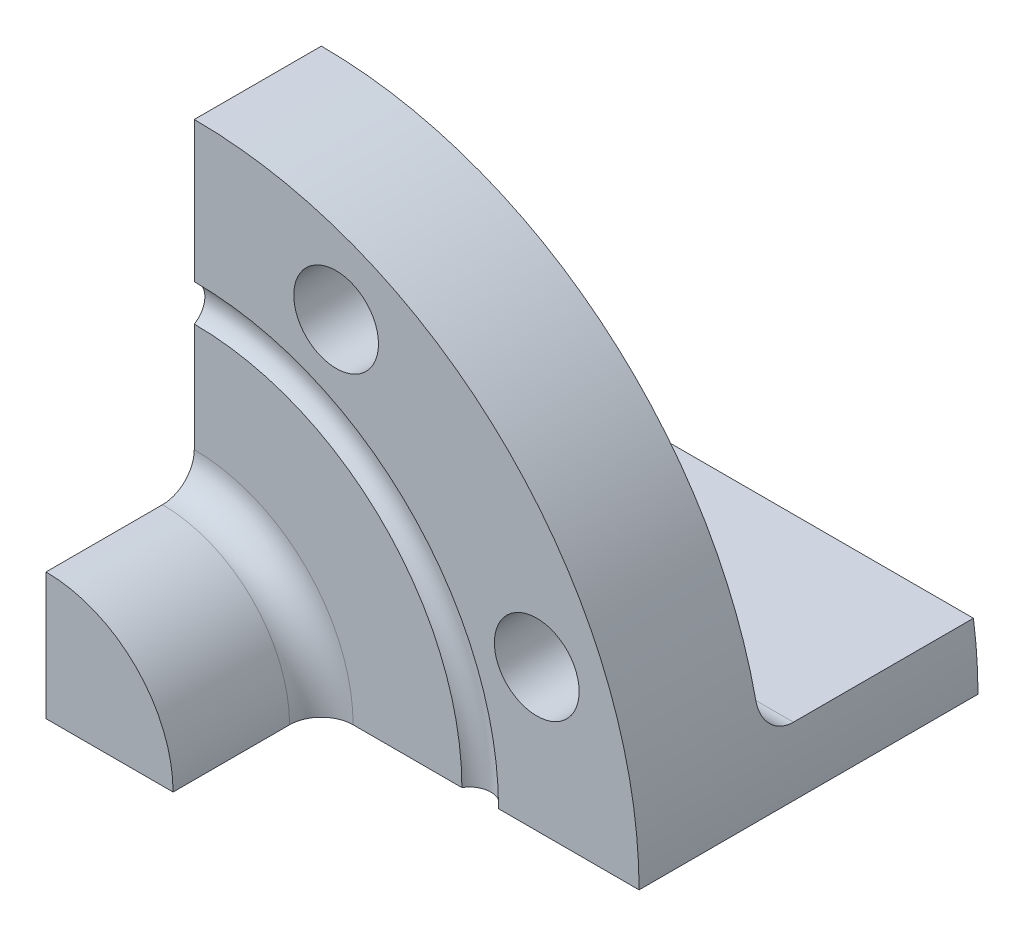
from build123d import *

# Parameters (mm, degrees)
SKIZZE1_R                            = 4
AUFSATZ_LINEAR_AUSTRAGEN1_DEPTH      = 12
AUFSATZ_LINEAR_AUSTRAGEN2_DEPTH      = 14
AUFSATZ_LINEAR_AUSTRAGEN2_DEPTH_BACK = 2
VERRUNDUNG1_R                        = 3
AUFSATZ_LINEAR_AUSTRAGEN3_DEPTH      = 20
AUFSATZ_LINEAR_AUSTRAGEN3_DEPTH_BACK = 2
SKIZZE4_R                            = 7
SCHNITT_LINEAR_AUSTRAGEN1_DEPTH      = 10
VERRUNDUNG2_R                        = 3
SKIZZE6_R                            = 2


with BuildPart() as part:
    # Skizze1 → Aufsatz-Linear austragen1 (new body)
    with BuildSketch(Plane.XY):
        with BuildLine():
            Line((0, 0), (42, 0))
            ThreePointArc((42, 0), (29.69848481, 29.69848481), (0, 42))
            Line((0, 42), (0, 0))
        make_face()
        with Locations((13.393920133, 32.335783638)):
            Circle(SKIZZE1_R, mode=Mode.SUBTRACT)
        with Locations((32.335783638, 13.393920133)):
            Circle(SKIZZE1_R, mode=Mode.SUBTRACT)
    extrude(amount=-AUFSATZ_LINEAR_AUSTRAGEN1_DEPTH)

    # Skizze2 → Aufsatz-Linear austragen2 (add, two sides: drawn at the far end of the back side and taken through both)
    with BuildSketch(Plane.XY.offset(-AUFSATZ_LINEAR_AUSTRAGEN2_DEPTH_BACK)):
        with BuildLine():
            Line((0, 12), (0, 0))
            Line((0, 0), (12, 0))
            ThreePointArc((12, 0), (8.485281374, 8.485281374), (0, 12))
        make_face()
    extrude(amount=AUFSATZ_LINEAR_AUSTRAGEN2_DEPTH + AUFSATZ_LINEAR_AUSTRAGEN2_DEPTH_BACK)

    # Verrundung1
    verrundung1_edges = [part.edges().sort_by_distance(p)[0] for p in [
        (8.485281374, 8.485281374, 0),
    ]]
    fillet(verrundung1_edges, radius=VERRUNDUNG1_R)

    # Skizze3 → Aufsatz-Linear austragen3 (add, two sides: drawn at the far end of the back side and taken through both)
    with BuildSketch(Plane(origin=(0, 0, -12), x_dir=(-1, 0, 0), z_dir=(0, 0, -1)).offset(-AUFSATZ_LINEAR_AUSTRAGEN3_DEPTH_BACK)):
        with BuildLine():
            Line((-41.569219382, 6), (0, 6))
            Line((0, 6), (0, 0))
            Line((0, 0), (-42, 0))
            ThreePointArc((-42, 0), (-41.892166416, 3.007722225), (-41.569219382, 6))
        make_face()
    extrude(amount=AUFSATZ_LINEAR_AUSTRAGEN3_DEPTH + AUFSATZ_LINEAR_AUSTRAGEN3_DEPTH_BACK)

    # Skizze4 → Schnitt-Linear austragen1 (cut, symmetric)
    with BuildSketch(Plane(origin=(0, 0, 0), x_dir=(1, 0, 0), z_dir=(0, 1, 0))):
        with Locations((0, 22)):
            Circle(SKIZZE4_R)
    extrude(amount=SCHNITT_LINEAR_AUSTRAGEN1_DEPTH, both=True, mode=Mode.SUBTRACT)

    # Verrundung2
    verrundung2_edges = [part.edges().sort_by_distance(p)[0] for p in [
        (20.784609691, 6, -12),
    ]]
    fillet(verrundung2_edges, radius=VERRUNDUNG2_R)

    # Skizze6 → Schnitt-Rotation1 (revolve, cut)
    with BuildSketch(Plane(origin=(0, 0, 0), x_dir=(0, 0, -1), z_dir=(1, 0, 0))):
        with Locations((-1, 27)):
            Circle(SKIZZE6_R)
    revolve(axis=Axis((0, 0, 23.212596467), (0, 0, -1)), mode=Mode.SUBTRACT)


solid = part.part
